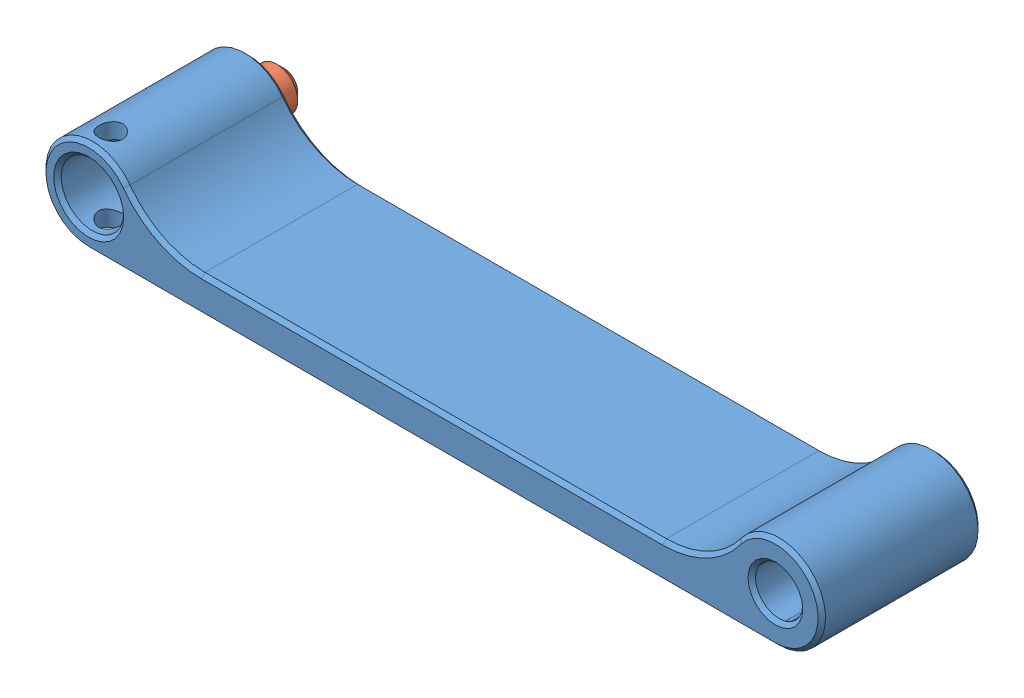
SolidWorks assembly TRIGGER GUARD ASSEMBLY.SLDASM, configuration Default (file format 11000). Lengths in mm.
Overall size (53.24 6.35 13.35).
2 component instances, 2 part files, 2 mates.
Components (placement in the parent):
- TRIGGER GUARD-1: TRIGGER GUARD.SLDPRT [Default] at origin size (53.24 6.35 10.92)
- TRIGGER GUARD SET PIN-1: TRIGGER GUARD SET PIN.SLDPRT [Default] at (3.175 3.175 2.9083) x (1 0 0) z (0 1 0) size (3.91 5.33 3.91)
Mates (geometry in assembly coordinates):
- Coincident1: coincident: plane of TRIGGER GUARD-1 through (10.8702 8.7884 2.1082) normal (0 0 1); plane of TRIGGER GUARD SET PIN-1 through (5.1308 3.175 2.1082) normal (0 0 -1)
- Concentric1: concentric: cylinder of TRIGGER GUARD-1 through (3.175 3.175 -6.0347) axis (0 0 1) radius 2.1336; cylinder of TRIGGER GUARD SET PIN-1 through (3.175 3.175 0.2413) axis (0 0 -1) radius 1.4351
